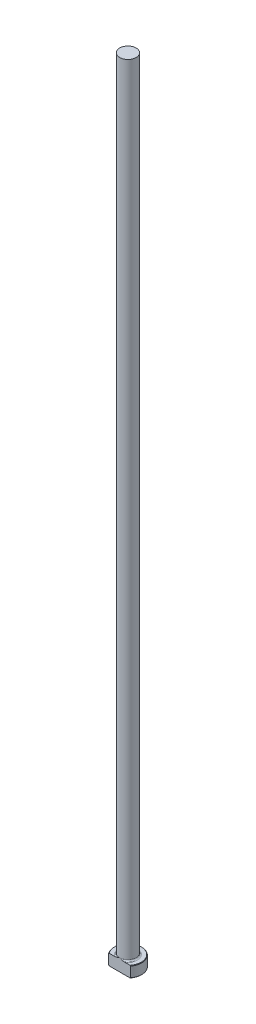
ISO-10303-21;
HEADER;
FILE_DESCRIPTION(('STEP AP214'),'2;1');
FILE_NAME('part.step','',(''),(''),'','','');
FILE_SCHEMA(('AUTOMOTIVE_DESIGN { 1 0 10303 214 1 1 1 1 }'));
ENDSEC;
DATA;
#1=APPLICATION_CONTEXT('core data for automotive mechanical design processes');
#2=APPLICATION_PROTOCOL_DEFINITION('international standard','automotive_design',2000,#1);
#3=PRODUCT_CONTEXT('',#1,'mechanical');
#4=PRODUCT('Part','Part','',(#3));
#5=PRODUCT_RELATED_PRODUCT_CATEGORY('part','',(#4));
#6=PRODUCT_DEFINITION_FORMATION('','',#4);
#7=PRODUCT_DEFINITION_CONTEXT('part definition',#1,'design');
#8=PRODUCT_DEFINITION('design','',#6,#7);
#9=PRODUCT_DEFINITION_SHAPE('','',#8);
#10=(LENGTH_UNIT() NAMED_UNIT(*) SI_UNIT(.MILLI.,.METRE.));
#11=(NAMED_UNIT(*) PLANE_ANGLE_UNIT() SI_UNIT($,.RADIAN.));
#12=(NAMED_UNIT(*) SI_UNIT($,.STERADIAN.) SOLID_ANGLE_UNIT());
#13=UNCERTAINTY_MEASURE_WITH_UNIT(LENGTH_MEASURE(1.E-05),#10,'distance_accuracy_value','');
#14=(GEOMETRIC_REPRESENTATION_CONTEXT(3) GLOBAL_UNCERTAINTY_ASSIGNED_CONTEXT((#13)) GLOBAL_UNIT_ASSIGNED_CONTEXT((#10,
#11,#12)) REPRESENTATION_CONTEXT('',''));
#15=CARTESIAN_POINT('',(0.,0.,0.));
#16=DIRECTION('',(0.,0.,1.));
#17=DIRECTION('',(1.,0.,0.));
#18=AXIS2_PLACEMENT_3D('',#15,#16,#17);
#19=CARTESIAN_POINT('',(0.,0.,0.));
#20=DIRECTION('',(0.,-1.,0.));
#21=DIRECTION('',(0.,0.,-1.));
#22=AXIS2_PLACEMENT_3D('',#19,#20,#21);
#23=PLANE('',#22);
#24=CARTESIAN_POINT('',(0.,0.,0.));
#25=DIRECTION('',(0.,-1.,0.));
#26=DIRECTION('',(0.,0.,-1.));
#27=AXIS2_PLACEMENT_3D('',#24,#25,#26);
#28=CIRCLE('',#27,7.68349999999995);
#29=CARTESIAN_POINT('',(-6.02949135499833,0.,4.76249999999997));
#30=VERTEX_POINT('',#29);
#31=CARTESIAN_POINT('',(6.02949135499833,0.,4.76249999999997));
#32=VERTEX_POINT('',#31);
#33=EDGE_CURVE('E98',#30,#32,#28,.T.);
#34=ORIENTED_EDGE('',*,*,#33,.T.);
#35=DIRECTION('',(-1.,0.,0.));
#36=VECTOR('',#35,1.);
#37=CARTESIAN_POINT('',(-6.34999999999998,0.,4.76249999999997));
#38=LINE('',#37,#36);
#39=EDGE_CURVE('E83',#32,#30,#38,.T.);
#40=ORIENTED_EDGE('',*,*,#39,.T.);
#41=EDGE_LOOP('',(#34,#40));
#42=FACE_BOUND('',#41,.T.);
#43=ADVANCED_FACE('F32',(#42),#23,.T.);
#44=CARTESIAN_POINT('',(0.,259.958771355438,0.));
#45=DIRECTION('',(0.,1.,0.));
#46=DIRECTION('',(0.,0.,1.));
#47=AXIS2_PLACEMENT_3D('',#44,#45,#46);
#48=CYLINDRICAL_SURFACE('',#47,7.93749999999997);
#49=CARTESIAN_POINT('',(0.,6.09599999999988,0.));
#50=DIRECTION('',(0.,1.,0.));
#51=DIRECTION('',(0.,0.,1.));
#52=AXIS2_PLACEMENT_3D('',#49,#50,#51);
#53=CIRCLE('',#52,7.93749999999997);
#54=CARTESIAN_POINT('',(-6.34999999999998,6.09599999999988,4.76249999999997));
#55=VERTEX_POINT('',#54);
#56=CARTESIAN_POINT('',(6.34999999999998,6.09599999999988,4.76249999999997));
#57=VERTEX_POINT('',#56);
#58=EDGE_CURVE('E104',#55,#57,#53,.F.);
#59=ORIENTED_EDGE('',*,*,#58,.T.);
#60=DIRECTION('',(0.,-1.,0.));
#61=VECTOR('',#60,1.);
#62=CARTESIAN_POINT('',(6.34999999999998,457.2,4.76249999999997));
#63=LINE('',#62,#61);
#64=CARTESIAN_POINT('',(6.34999999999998,0.254000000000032,4.76249999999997));
#65=VERTEX_POINT('',#64);
#66=EDGE_CURVE('E183',#57,#65,#63,.T.);
#67=ORIENTED_EDGE('',*,*,#66,.T.);
#68=CARTESIAN_POINT('',(0.,0.254000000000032,0.));
#69=DIRECTION('',(0.,-1.,0.));
#70=DIRECTION('',(0.,0.,-1.));
#71=AXIS2_PLACEMENT_3D('',#68,#69,#70);
#72=CIRCLE('',#71,7.93749999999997);
#73=CARTESIAN_POINT('',(-6.34999999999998,0.254000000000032,4.76249999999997));
#74=VERTEX_POINT('',#73);
#75=EDGE_CURVE('E100',#65,#74,#72,.F.);
#76=ORIENTED_EDGE('',*,*,#75,.T.);
#77=DIRECTION('',(0.,-1.,0.));
#78=VECTOR('',#77,1.);
#79=CARTESIAN_POINT('',(-6.34999999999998,457.2,4.76249999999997));
#80=LINE('',#79,#78);
#81=EDGE_CURVE('E93',#55,#74,#80,.T.);
#82=ORIENTED_EDGE('',*,*,#81,.F.);
#83=EDGE_LOOP('',(#59,#67,#76,#82));
#84=FACE_BOUND('',#83,.T.);
#85=ADVANCED_FACE('F158',(#84),#48,.T.);
#86=CARTESIAN_POINT('',(-7.93749999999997,6.35,0.));
#87=DIRECTION('',(0.,1.,0.));
#88=DIRECTION('',(0.,0.,1.));
#89=AXIS2_PLACEMENT_3D('',#86,#87,#88);
#90=PLANE('',#89);
#91=CARTESIAN_POINT('',(0.,6.35,0.));
#92=DIRECTION('',(0.,1.,0.));
#93=DIRECTION('',(0.,0.,1.));
#94=AXIS2_PLACEMENT_3D('',#91,#92,#93);
#95=CIRCLE('',#94,7.68349999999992);
#96=CARTESIAN_POINT('',(6.02949135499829,6.35,4.76249999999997));
#97=VERTEX_POINT('',#96);
#98=CARTESIAN_POINT('',(-6.02949135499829,6.35,4.76249999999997));
#99=VERTEX_POINT('',#98);
#100=EDGE_CURVE('E178',#97,#99,#95,.T.);
#101=ORIENTED_EDGE('',*,*,#100,.T.);
#102=DIRECTION('',(1.,0.,0.));
#103=VECTOR('',#102,1.);
#104=CARTESIAN_POINT('',(-7.93749999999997,6.35,4.76249999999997));
#105=LINE('',#104,#103);
#106=CARTESIAN_POINT('',(-2.79976677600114,6.35000000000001,4.76249999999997));
#107=VERTEX_POINT('',#106);
#108=EDGE_CURVE('E57',#99,#107,#105,.T.);
#109=ORIENTED_EDGE('',*,*,#108,.T.);
#110=CARTESIAN_POINT('',(0.,6.35,0.));
#111=DIRECTION('',(0.,1.,0.));
#112=DIRECTION('',(0.,0.,1.));
#113=AXIS2_PLACEMENT_3D('',#110,#111,#112);
#114=CIRCLE('',#113,5.52449999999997);
#115=CARTESIAN_POINT('',(2.79976677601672,6.35000000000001,4.76249999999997));
#116=VERTEX_POINT('',#115);
#117=EDGE_CURVE('E107',#107,#116,#114,.F.);
#118=ORIENTED_EDGE('',*,*,#117,.T.);
#119=EDGE_CURVE('E136',#116,#97,#105,.T.);
#120=ORIENTED_EDGE('',*,*,#119,.T.);
#121=EDGE_LOOP('',(#101,#109,#118,#120));
#122=FACE_BOUND('',#121,.T.);
#123=ADVANCED_FACE('F147',(#122),#90,.T.);
#124=CARTESIAN_POINT('',(0.,6.35000000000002,0.));
#125=DIRECTION('',(0.,-1.,0.));
#126=DIRECTION('',(0.,0.,-1.));
#127=AXIS2_PLACEMENT_3D('',#124,#125,#126);
#128=CONICAL_SURFACE('',#127,7.6834999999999,0.785398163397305);
#129=ORIENTED_EDGE('',*,*,#58,.F.);
#130=CARTESIAN_POINT('',(-13.9717238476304,-0.727613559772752,4.76249999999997));
#131=CARTESIAN_POINT('',(-13.7440124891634,-0.512084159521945,4.76249999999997));
#132=CARTESIAN_POINT('',(-13.5160318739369,-0.296838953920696,4.76249999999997));
#133=CARTESIAN_POINT('',(-13.0594385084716,0.132982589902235,4.76249999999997));
#134=CARTESIAN_POINT('',(-12.8308257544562,0.347558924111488,4.76249999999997));
#135=CARTESIAN_POINT('',(-12.1433698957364,0.990628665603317,4.76249999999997));
#136=CARTESIAN_POINT('',(-11.6834388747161,1.41796058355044,4.76249999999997));
#137=CARTESIAN_POINT('',(-10.7398192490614,2.28660831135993,4.76249999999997));
#138=CARTESIAN_POINT('',(-10.2559580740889,2.72773732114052,4.76249999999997));
#139=CARTESIAN_POINT('',(-9.52579613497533,3.38404130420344,4.76249999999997));
#140=CARTESIAN_POINT('',(-9.28181372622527,3.60179461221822,4.76249999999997));
#141=CARTESIAN_POINT('',(-8.79195583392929,4.0351595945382,4.76249999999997));
#142=CARTESIAN_POINT('',(-8.54608036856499,4.25077128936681,4.76249999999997));
#143=CARTESIAN_POINT('',(-8.05235063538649,4.67899963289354,4.76249999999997));
#144=CARTESIAN_POINT('',(-7.80449972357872,4.89162014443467,4.76249999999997));
#145=CARTESIAN_POINT('',(-7.30587283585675,5.31343752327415,4.76249999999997));
#146=CARTESIAN_POINT('',(-7.05509670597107,5.5226342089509,4.76249999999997));
#147=CARTESIAN_POINT('',(-6.54895570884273,5.9372628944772,4.76249999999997));
#148=CARTESIAN_POINT('',(-6.29357776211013,6.1426789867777,4.76249999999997));
#149=CARTESIAN_POINT('',(-5.77806261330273,6.54738613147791,4.76249999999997));
#150=CARTESIAN_POINT('',(-5.51792616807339,6.74667814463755,4.76249999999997));
#151=CARTESIAN_POINT('',(-4.99669315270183,7.1329036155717,4.76249999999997));
#152=CARTESIAN_POINT('',(-4.73572280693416,7.32000565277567,4.76249999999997));
#153=CARTESIAN_POINT('',(-4.33820944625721,7.5920559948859,4.76249999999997));
#154=CARTESIAN_POINT('',(-4.20463607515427,7.68134253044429,4.76249999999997));
#155=CARTESIAN_POINT('',(-3.93520014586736,7.85638938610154,4.76249999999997));
#156=CARTESIAN_POINT('',(-3.79933771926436,7.94214990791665,4.76249999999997));
#157=CARTESIAN_POINT('',(-3.52582078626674,8.10887856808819,4.76249999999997));
#158=CARTESIAN_POINT('',(-3.38818211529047,8.18987258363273,4.76249999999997));
#159=CARTESIAN_POINT('',(-3.10994368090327,8.34667799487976,4.76249999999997));
#160=CARTESIAN_POINT('',(-2.96934354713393,8.42248873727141,4.76249999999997));
#161=CARTESIAN_POINT('',(-2.6850931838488,8.56758570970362,4.76249999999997));
#162=CARTESIAN_POINT('',(-2.5414484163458,8.63688258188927,4.76249999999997));
#163=CARTESIAN_POINT('',(-2.25062082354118,8.76758710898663,4.76249999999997));
#164=CARTESIAN_POINT('',(-2.10343915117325,8.82899729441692,4.76249999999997));
#165=CARTESIAN_POINT('',(-1.88433335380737,8.91218004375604,4.76249999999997));
#166=CARTESIAN_POINT('',(-1.81383186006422,8.93772120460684,4.76249999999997));
#167=CARTESIAN_POINT('',(-1.67202052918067,8.98645907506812,4.76249999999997));
#168=CARTESIAN_POINT('',(-1.6007106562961,9.00965568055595,4.76249999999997));
#169=CARTESIAN_POINT('',(-1.38555472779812,9.07542289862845,4.76249999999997));
#170=CARTESIAN_POINT('',(-1.24050522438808,9.11416209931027,4.76249999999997));
#171=CARTESIAN_POINT('',(-0.948515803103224,9.17953563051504,4.76249999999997));
#172=CARTESIAN_POINT('',(-0.801590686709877,9.20623542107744,4.76249999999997));
#173=CARTESIAN_POINT('',(-0.50593058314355,9.24644001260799,4.76249999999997));
#174=CARTESIAN_POINT('',(-0.357195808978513,9.2599463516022,4.76249999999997));
#175=CARTESIAN_POINT('',(-0.0580773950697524,9.27300540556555,4.76249999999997));
#176=CARTESIAN_POINT('',(0.0923105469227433,9.27246142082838,4.76249999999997));
#177=CARTESIAN_POINT('',(0.392354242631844,9.25721584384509,4.76249999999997));
#178=CARTESIAN_POINT('',(0.542009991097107,9.24251415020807,4.76249999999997));
#179=CARTESIAN_POINT('',(0.840076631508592,9.19973713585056,4.76249999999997));
#180=CARTESIAN_POINT('',(0.988478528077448,9.17160009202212,4.76249999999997));
#181=CARTESIAN_POINT('',(1.28250292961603,9.10341431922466,4.76249999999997));
#182=CARTESIAN_POINT('',(1.42812484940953,9.06336311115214,4.76249999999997));
#183=CARTESIAN_POINT('',(1.80157652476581,8.94630142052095,4.76249999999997));
#184=CARTESIAN_POINT('',(2.02694427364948,8.86145845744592,4.76249999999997));
#185=CARTESIAN_POINT('',(2.46947102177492,8.67257542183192,4.76249999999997));
#186=CARTESIAN_POINT('',(2.68662307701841,8.56851952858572,4.76249999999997));
#187=CARTESIAN_POINT('',(3.00782565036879,8.40144847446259,4.76249999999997));
#188=CARTESIAN_POINT('',(3.11463323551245,8.34362692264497,4.76249999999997));
#189=CARTESIAN_POINT('',(3.32653927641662,8.22492412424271,4.76249999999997));
#190=CARTESIAN_POINT('',(3.43163771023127,8.1640428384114,4.76249999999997));
#191=CARTESIAN_POINT('',(3.64022442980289,8.03970047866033,4.76249999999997));
#192=CARTESIAN_POINT('',(3.7437134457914,7.97624062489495,4.76249999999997));
#193=CARTESIAN_POINT('',(3.94927417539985,7.84708004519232,4.76249999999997));
#194=CARTESIAN_POINT('',(4.05134594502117,7.7813794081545,4.76249999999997));
#195=CARTESIAN_POINT('',(4.39010681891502,7.55875403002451,4.76249999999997));
#196=CARTESIAN_POINT('',(4.62396840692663,7.39752115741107,4.76249999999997));
#197=CARTESIAN_POINT('',(5.08629215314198,7.06746483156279,4.76249999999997));
#198=CARTESIAN_POINT('',(5.31475310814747,6.8986397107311,4.76249999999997));
#199=CARTESIAN_POINT('',(5.76756292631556,6.55523763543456,4.76249999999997));
#200=CARTESIAN_POINT('',(5.9919086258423,6.38065652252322,4.76249999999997));
#201=CARTESIAN_POINT('',(6.43717517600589,6.02723273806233,4.76249999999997));
#202=CARTESIAN_POINT('',(6.65809630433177,5.84839041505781,4.76249999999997));
#203=CARTESIAN_POINT('',(7.09790647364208,5.48680641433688,4.76249999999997));
#204=CARTESIAN_POINT('',(7.31678672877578,5.30405407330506,4.76249999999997));
#205=CARTESIAN_POINT('',(7.75231370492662,4.93590430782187,4.76249999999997));
#206=CARTESIAN_POINT('',(7.96896038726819,4.75050683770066,4.76249999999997));
#207=CARTESIAN_POINT('',(8.4003252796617,4.37766695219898,4.76249999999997));
#208=CARTESIAN_POINT('',(8.61504426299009,4.19022543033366,4.76249999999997));
#209=CARTESIAN_POINT('',(9.04295707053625,3.81360841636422,4.76249999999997));
#210=CARTESIAN_POINT('',(9.25615088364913,3.62443291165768,4.76249999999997));
#211=CARTESIAN_POINT('',(9.85099823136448,3.09302727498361,4.76249999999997));
#212=CARTESIAN_POINT('',(10.2312296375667,2.74920552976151,4.76249999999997));
#213=CARTESIAN_POINT('',(10.9886755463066,2.05817278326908,4.76249999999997));
#214=CARTESIAN_POINT('',(11.3658896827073,1.71096138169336,4.76249999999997));
#215=CARTESIAN_POINT('',(12.1155837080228,1.01624347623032,4.76249999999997));
#216=CARTESIAN_POINT('',(12.4880784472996,0.668752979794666,4.76249999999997));
#217=CARTESIAN_POINT('',(13.2311819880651,-0.0281268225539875,4.76249999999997));
#218=CARTESIAN_POINT('',(13.601791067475,-0.377515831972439,4.76249999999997));
#219=CARTESIAN_POINT('',(13.9717238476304,-0.727613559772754,4.76249999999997));
#220=B_SPLINE_CURVE_WITH_KNOTS('',3,(#130,#131,#132,#133,#134,#135,#136,#137,#138,#139,#140,
#141,#142,#143,#144,#145,#146,#147,#148,#149,#150,#151,#152,#153,#154,#155,#156,#157,#158,#159,
#160,#161,#162,#163,#164,#165,#166,#167,#168,#169,#170,#171,#172,#173,#174,#175,#176,#177,#178,
#179,#180,#181,#182,#183,#184,#185,#186,#187,#188,#189,#190,#191,#192,#193,#194,#195,#196,#197,
#198,#199,#200,#201,#202,#203,#204,#205,#206,#207,#208,#209,#210,#211,#212,#213,#214,#215,#216,
#217,#218,#219),.UNSPECIFIED.,.F.,.F.,(4,2,2,2,2,2,2,2,2,2,2,2,2,2,2,2,2,2,2,2,2,2,2,2,2,2,2,2,
2,2,2,2,2,2,2,2,2,2,2,2,2,2,2,2,4),(0.,0.940610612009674,1.88122685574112,3.76464908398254,
5.72889030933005,6.7099492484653,7.69099877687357,8.67063680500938,9.65032663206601,
10.6334769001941,11.6164721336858,12.5795523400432,13.0615108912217,13.543441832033,
14.022454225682,14.5015268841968,14.9798027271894,15.457924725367,15.6828447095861,
15.9077746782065,16.3577079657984,16.8051644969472,17.2525688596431,17.703053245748,
18.1535408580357,18.606118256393,19.0587898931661,19.779913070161,20.5016327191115,
20.8659558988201,21.2302837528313,21.5944411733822,21.958584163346,22.8105074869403,
23.6626188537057,24.515359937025,25.3680315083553,26.2234368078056,27.0788568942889,
27.9339169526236,28.7889832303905,30.3268416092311,31.8648838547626,33.393116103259,
34.9211161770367),.UNSPECIFIED.);
#221=EDGE_CURVE('E135',#55,#99,#220,.T.);
#222=ORIENTED_EDGE('',*,*,#221,.T.);
#223=ORIENTED_EDGE('',*,*,#100,.F.);
#224=EDGE_CURVE('E127',#97,#57,#220,.T.);
#225=ORIENTED_EDGE('',*,*,#224,.T.);
#226=EDGE_LOOP('',(#129,#222,#223,#225));
#227=FACE_BOUND('',#226,.T.);
#228=ADVANCED_FACE('F143',(#227),#128,.T.);
#229=CARTESIAN_POINT('',(0.,0.254000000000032,0.));
#230=DIRECTION('',(0.,1.,0.));
#231=DIRECTION('',(0.,0.,1.));
#232=AXIS2_PLACEMENT_3D('',#229,#230,#231);
#233=CONICAL_SURFACE('',#232,7.93749999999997,0.785398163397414);
#234=ORIENTED_EDGE('',*,*,#75,.F.);
#235=CARTESIAN_POINT('',(13.9717238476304,7.07761355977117,4.76249999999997));
#236=CARTESIAN_POINT('',(13.7440124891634,6.8620841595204,4.76249999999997));
#237=CARTESIAN_POINT('',(13.5160318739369,6.64683895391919,4.76249999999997));
#238=CARTESIAN_POINT('',(13.0594385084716,6.21701741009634,4.76249999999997));
#239=CARTESIAN_POINT('',(12.8308257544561,6.00244107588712,4.76249999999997));
#240=CARTESIAN_POINT('',(12.1433698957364,5.3593713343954,4.76249999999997));
#241=CARTESIAN_POINT('',(11.683438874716,4.93203941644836,4.76249999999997));
#242=CARTESIAN_POINT('',(10.7398192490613,4.06339168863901,4.76249999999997));
#243=CARTESIAN_POINT('',(10.2559580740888,3.6222626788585,4.76249999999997));
#244=CARTESIAN_POINT('',(9.52579613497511,2.96595869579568,4.76249999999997));
#245=CARTESIAN_POINT('',(9.28181372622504,2.74820538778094,4.76249999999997));
#246=CARTESIAN_POINT('',(8.79195583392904,2.31484040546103,4.76249999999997));
#247=CARTESIAN_POINT('',(8.54608036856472,2.09922871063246,4.76249999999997));
#248=CARTESIAN_POINT('',(8.0523506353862,1.67100036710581,4.76249999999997));
#249=CARTESIAN_POINT('',(7.80449972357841,1.45837985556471,4.76249999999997));
#250=CARTESIAN_POINT('',(7.30587283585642,1.03656247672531,4.76249999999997));
#251=CARTESIAN_POINT('',(7.05509670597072,0.827365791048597,4.76249999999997));
#252=CARTESIAN_POINT('',(6.54895570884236,0.412737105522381,4.76249999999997));
#253=CARTESIAN_POINT('',(6.29357776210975,0.207321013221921,4.76249999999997));
#254=CARTESIAN_POINT('',(5.77806261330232,-0.197386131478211,4.76249999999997));
#255=CARTESIAN_POINT('',(5.51792616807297,-0.396678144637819,4.76249999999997));
#256=CARTESIAN_POINT('',(4.99669315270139,-0.782903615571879,4.76249999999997));
#257=CARTESIAN_POINT('',(4.73572280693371,-0.970005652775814,4.76249999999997));
#258=CARTESIAN_POINT('',(4.33820944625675,-1.24205599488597,4.76249999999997));
#259=CARTESIAN_POINT('',(4.2046360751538,-1.33134253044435,4.76249999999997));
#260=CARTESIAN_POINT('',(3.93520014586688,-1.50638938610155,4.76249999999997));
#261=CARTESIAN_POINT('',(3.79933771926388,-1.59214990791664,4.76249999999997));
#262=CARTESIAN_POINT('',(3.52582078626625,-1.75887856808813,4.76249999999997));
#263=CARTESIAN_POINT('',(3.38818211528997,-1.83987258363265,4.76249999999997));
#264=CARTESIAN_POINT('',(3.10994368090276,-1.99667799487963,4.76249999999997));
#265=CARTESIAN_POINT('',(2.96934354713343,-2.07248873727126,4.76249999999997));
#266=CARTESIAN_POINT('',(2.68509318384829,-2.21758570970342,4.76249999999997));
#267=CARTESIAN_POINT('',(2.54144841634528,-2.28688258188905,4.76249999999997));
#268=CARTESIAN_POINT('',(2.25062082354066,-2.41758710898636,4.76249999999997));
#269=CARTESIAN_POINT('',(2.10343915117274,-2.47899729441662,4.76249999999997));
#270=CARTESIAN_POINT('',(1.88433335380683,-2.56218004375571,4.76249999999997));
#271=CARTESIAN_POINT('',(1.81383186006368,-2.58772120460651,4.76249999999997));
#272=CARTESIAN_POINT('',(1.6720205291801,-2.63645907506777,4.76249999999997));
#273=CARTESIAN_POINT('',(1.60071065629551,-2.65965568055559,4.76249999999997));
#274=CARTESIAN_POINT('',(1.38555472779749,-2.72542289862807,4.76249999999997));
#275=CARTESIAN_POINT('',(1.24050522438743,-2.76416209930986,4.76249999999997));
#276=CARTESIAN_POINT('',(0.948515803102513,-2.8295356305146,4.76249999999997));
#277=CARTESIAN_POINT('',(0.801590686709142,-2.85623542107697,4.76249999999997));
#278=CARTESIAN_POINT('',(0.505930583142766,-2.89644001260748,4.76249999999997));
#279=CARTESIAN_POINT('',(0.357195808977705,-2.90994635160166,4.76249999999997));
#280=CARTESIAN_POINT('',(0.0580773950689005,-2.92300540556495,4.76249999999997));
#281=CARTESIAN_POINT('',(-0.0923105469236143,-2.92246142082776,4.76249999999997));
#282=CARTESIAN_POINT('',(-0.392354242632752,-2.90721584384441,4.76249999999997));
#283=CARTESIAN_POINT('',(-0.542009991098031,-2.89251415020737,4.76249999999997));
#284=CARTESIAN_POINT('',(-0.840076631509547,-2.8497371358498,4.76249999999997));
#285=CARTESIAN_POINT('',(-0.988478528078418,-2.82160009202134,4.76249999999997));
#286=CARTESIAN_POINT('',(-1.28250292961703,-2.75341431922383,4.76249999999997));
#287=CARTESIAN_POINT('',(-1.42812484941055,-2.71336311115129,4.76249999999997));
#288=CARTESIAN_POINT('',(-1.80157652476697,-2.59630142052,4.76249999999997));
#289=CARTESIAN_POINT('',(-2.02694427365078,-2.5114584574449,4.76249999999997));
#290=CARTESIAN_POINT('',(-2.46947102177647,-2.32257542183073,4.76249999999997));
#291=CARTESIAN_POINT('',(-2.68662307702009,-2.21851952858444,4.76249999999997));
#292=CARTESIAN_POINT('',(-3.00782565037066,-2.05144847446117,4.76249999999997));
#293=CARTESIAN_POINT('',(-3.11463323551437,-1.99362692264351,4.76249999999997));
#294=CARTESIAN_POINT('',(-3.32653927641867,-1.87492412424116,4.76249999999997));
#295=CARTESIAN_POINT('',(-3.43163771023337,-1.8140428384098,4.76249999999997));
#296=CARTESIAN_POINT('',(-3.64022442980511,-1.68970047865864,4.76249999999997));
#297=CARTESIAN_POINT('',(-3.74371344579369,-1.62624062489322,4.76249999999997));
#298=CARTESIAN_POINT('',(-3.94927417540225,-1.49708004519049,4.76249999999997));
#299=CARTESIAN_POINT('',(-4.05134594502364,-1.43137940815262,4.76249999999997));
#300=CARTESIAN_POINT('',(-4.39010681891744,-1.20875403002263,4.76249999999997));
#301=CARTESIAN_POINT('',(-4.62396840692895,-1.04752115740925,4.76249999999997));
#302=CARTESIAN_POINT('',(-5.08629215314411,-0.717464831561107,4.76249999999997));
#303=CARTESIAN_POINT('',(-5.31475310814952,-0.548639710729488,4.76249999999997));
#304=CARTESIAN_POINT('',(-5.76756292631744,-0.205237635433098,4.76249999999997));
#305=CARTESIAN_POINT('',(-5.9919086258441,-0.0306565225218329,4.76249999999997));
#306=CARTESIAN_POINT('',(-6.43717517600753,0.32276726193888,4.76249999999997));
#307=CARTESIAN_POINT('',(-6.65809630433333,0.501609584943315,4.76249999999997));
#308=CARTESIAN_POINT('',(-7.09790647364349,0.863193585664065,4.76249999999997));
#309=CARTESIAN_POINT('',(-7.31678672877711,1.0459459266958,4.76249999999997));
#310=CARTESIAN_POINT('',(-7.75231370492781,1.4140956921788,4.76249999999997));
#311=CARTESIAN_POINT('',(-7.96896038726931,1.59949316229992,4.76249999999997));
#312=CARTESIAN_POINT('',(-8.40032527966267,1.9723330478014,4.76249999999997));
#313=CARTESIAN_POINT('',(-8.615044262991,2.15977456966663,4.76249999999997));
#314=CARTESIAN_POINT('',(-9.04295707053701,2.53639158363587,4.76249999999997));
#315=CARTESIAN_POINT('',(-9.25615088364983,2.72556708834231,4.76249999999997));
#316=CARTESIAN_POINT('',(-9.85099823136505,3.25697272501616,4.76249999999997));
#317=CARTESIAN_POINT('',(-10.2312296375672,3.60079447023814,4.76249999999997));
#318=CARTESIAN_POINT('',(-10.988675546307,4.29182721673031,4.76249999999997));
#319=CARTESIAN_POINT('',(-11.3658896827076,4.6390386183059,4.76249999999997));
#320=CARTESIAN_POINT('',(-12.115583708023,5.33375652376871,4.76249999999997));
#321=CARTESIAN_POINT('',(-12.4880784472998,5.68124702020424,4.76249999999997));
#322=CARTESIAN_POINT('',(-13.2311819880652,6.37812682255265,4.76249999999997));
#323=CARTESIAN_POINT('',(-13.601791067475,6.72751583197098,4.76249999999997));
#324=CARTESIAN_POINT('',(-13.9717238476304,7.07761355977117,4.76249999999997));
#325=B_SPLINE_CURVE_WITH_KNOTS('',3,(#235,#236,#237,#238,#239,#240,#241,#242,#243,#244,#245,
#246,#247,#248,#249,#250,#251,#252,#253,#254,#255,#256,#257,#258,#259,#260,#261,#262,#263,#264,
#265,#266,#267,#268,#269,#270,#271,#272,#273,#274,#275,#276,#277,#278,#279,#280,#281,#282,#283,
#284,#285,#286,#287,#288,#289,#290,#291,#292,#293,#294,#295,#296,#297,#298,#299,#300,#301,#302,
#303,#304,#305,#306,#307,#308,#309,#310,#311,#312,#313,#314,#315,#316,#317,#318,#319,#320,#321,
#322,#323,#324),.UNSPECIFIED.,.F.,.F.,(4,2,2,2,2,2,2,2,2,2,2,2,2,2,2,2,2,2,2,2,2,2,2,2,2,2,2,2,
2,2,2,2,2,2,2,2,2,2,2,2,2,2,2,2,4),(0.,0.94061061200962,1.88122685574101,3.76464908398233,
5.72889030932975,6.70994924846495,7.69099877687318,8.67063680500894,9.65032663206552,
10.6334769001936,11.6164721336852,12.5795523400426,13.061510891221,13.5434418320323,
14.0224542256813,14.5015268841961,14.9798027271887,15.4579247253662,15.6828447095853,
15.9077746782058,16.3577079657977,16.8051644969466,17.2525688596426,17.7030532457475,
18.1535408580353,18.6061182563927,19.0587898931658,19.7799130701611,20.5016327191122,
20.8659558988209,21.2302837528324,21.5944411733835,21.9585841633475,22.8105074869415,
23.6626188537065,24.5153599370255,25.3680315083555,26.2234368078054,27.0788568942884,
27.9339169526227,28.7889832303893,30.3268416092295,31.8648838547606,33.3931161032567,
34.921116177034),.UNSPECIFIED.);
#326=EDGE_CURVE('E86',#65,#32,#325,.T.);
#327=ORIENTED_EDGE('',*,*,#326,.T.);
#328=ORIENTED_EDGE('',*,*,#33,.F.);
#329=EDGE_CURVE('E89',#30,#74,#325,.T.);
#330=ORIENTED_EDGE('',*,*,#329,.T.);
#331=EDGE_LOOP('',(#234,#327,#328,#330));
#332=FACE_BOUND('',#331,.T.);
#333=ADVANCED_FACE('F97',(#332),#233,.T.);
#334=CARTESIAN_POINT('',(0.,7.11200000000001,0.));
#335=DIRECTION('',(0.,1.,0.));
#336=DIRECTION('',(0.,0.,1.));
#337=AXIS2_PLACEMENT_3D('',#334,#335,#336);
#338=TOROIDAL_SURFACE('',#337,5.52449999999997,0.762);
#339=CARTESIAN_POINT('',(0.,7.11200000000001,4.76249999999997));
#340=CARTESIAN_POINT('',(1.7571576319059E-10,7.11200099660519,4.76249999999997));
#341=CARTESIAN_POINT('',(2.11716127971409E-07,7.11200199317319,4.76249999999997));
#342=CARTESIAN_POINT('',(8.80753956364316E-07,7.1120039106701,4.76249999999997));
#343=CARTESIAN_POINT('',(1.34491796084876E-06,7.11200482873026,4.76249999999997));
#344=CARTESIAN_POINT('',(2.45982947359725E-06,7.11200666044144,4.76249999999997));
#345=CARTESIAN_POINT('',(3.12384157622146E-06,7.11200756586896,4.76249999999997));
#346=CARTESIAN_POINT('',(4.5550794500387E-06,7.11200927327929,4.76249999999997));
#347=CARTESIAN_POINT('',(5.32136303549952E-06,7.11201007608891,4.76249999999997));
#348=CARTESIAN_POINT('',(8.07192927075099E-06,7.11201277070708,4.76249999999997));
#349=CARTESIAN_POINT('',(1.01901643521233E-05,7.11201452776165,4.76249999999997));
#350=CARTESIAN_POINT('',(1.4565159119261E-05,7.11201765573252,4.76249999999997));
#351=CARTESIAN_POINT('',(1.68139275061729E-05,7.11201903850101,4.76249999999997));
#352=CARTESIAN_POINT('',(2.56002968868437E-05,7.1120242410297,4.76249999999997));
#353=CARTESIAN_POINT('',(3.23057719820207E-05,7.11202779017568,4.76249999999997));
#354=CARTESIAN_POINT('',(4.55210144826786E-05,7.11203358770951,4.76249999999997));
#355=CARTESIAN_POINT('',(5.19929180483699E-05,7.1120359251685,4.76249999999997));
#356=CARTESIAN_POINT('',(7.95921607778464E-05,7.11204586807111,4.76249999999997));
#357=CARTESIAN_POINT('',(0.000100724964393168,7.11205341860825,4.76249999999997));
#358=CARTESIAN_POINT('',(0.00014026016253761,7.11206552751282,4.76249999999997));
#359=CARTESIAN_POINT('',(0.000158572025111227,7.11207036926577,4.76249999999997));
#360=CARTESIAN_POINT('',(0.000291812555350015,7.11210874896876,4.76249999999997));
#361=CARTESIAN_POINT('',(0.000401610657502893,7.11215771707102,4.76249999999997));
#362=CARTESIAN_POINT('',(0.0008287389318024,7.1123412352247,4.76249999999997));
#363=CARTESIAN_POINT('',(0.00114963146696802,7.11246431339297,4.76249999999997));
#364=CARTESIAN_POINT('',(0.00239628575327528,7.11294956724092,4.76249999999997));
#365=CARTESIAN_POINT('',(0.00331839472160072,7.11332376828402,4.76249999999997));
#366=CARTESIAN_POINT('',(0.00709602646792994,7.11484953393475,4.76249999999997));
#367=CARTESIAN_POINT('',(0.00995556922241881,7.11598757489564,4.76249999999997));
#368=CARTESIAN_POINT('',(0.0776380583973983,7.14293320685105,4.76249999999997));
#369=CARTESIAN_POINT('',(0.142407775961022,7.16892226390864,4.76249999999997));
#370=CARTESIAN_POINT('',(0.269647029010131,7.2196189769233,4.76249999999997));
#371=CARTESIAN_POINT('',(0.332112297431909,7.24433828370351,4.76249999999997));
#372=CARTESIAN_POINT('',(0.464537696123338,7.29630170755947,4.76249999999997));
#373=CARTESIAN_POINT('',(0.534515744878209,7.32350106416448,4.76249999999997));
#374=CARTESIAN_POINT('',(0.67548014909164,7.3774238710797,4.76249999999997));
#375=CARTESIAN_POINT('',(0.746469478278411,7.40413956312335,4.76249999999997));
#376=CARTESIAN_POINT('',(0.870073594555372,7.44962494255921,4.76249999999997));
#377=CARTESIAN_POINT('',(0.922600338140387,7.46863321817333,4.76249999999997));
#378=CARTESIAN_POINT('',(1.02776923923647,7.50591527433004,4.76249999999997));
#379=CARTESIAN_POINT('',(1.08041080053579,7.52419073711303,4.76249999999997));
#380=CARTESIAN_POINT('',(1.23635883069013,7.5769919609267,4.76249999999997));
#381=CARTESIAN_POINT('',(1.34005657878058,7.61037532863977,4.76249999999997));
#382=CARTESIAN_POINT('',(1.56359060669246,7.67746997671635,4.76249999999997));
#383=CARTESIAN_POINT('',(1.68362015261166,7.71054957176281,4.76249999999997));
#384=CARTESIAN_POINT('',(1.92642555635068,7.76967498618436,4.76249999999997));
#385=CARTESIAN_POINT('',(2.04921557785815,7.79566353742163,4.76249999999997));
#386=CARTESIAN_POINT('',(2.30422797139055,7.83918726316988,4.76249999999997));
#387=CARTESIAN_POINT('',(2.43656426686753,7.85610069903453,4.76249999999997));
#388=CARTESIAN_POINT('',(2.63563546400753,7.8702758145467,4.76249999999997));
#389=CARTESIAN_POINT('',(2.70197039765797,7.87313972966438,4.76249999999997));
#390=CARTESIAN_POINT('',(2.83467605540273,7.87452977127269,4.76249999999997));
#391=CARTESIAN_POINT('',(2.90104677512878,7.87305634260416,4.76249999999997));
#392=CARTESIAN_POINT('',(3.06624711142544,7.86305254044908,4.76249999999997));
#393=CARTESIAN_POINT('',(3.1649502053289,7.85140164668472,4.76249999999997));
#394=CARTESIAN_POINT('',(3.3102514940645,7.82310986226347,4.76249999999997));
#395=CARTESIAN_POINT('',(3.35793795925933,7.81197880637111,4.76249999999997));
#396=CARTESIAN_POINT('',(3.45215770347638,7.78564548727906,4.76249999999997));
#397=CARTESIAN_POINT('',(3.49869187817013,7.77044650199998,4.76249999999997));
#398=CARTESIAN_POINT('',(3.59306902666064,7.73421407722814,4.76249999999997));
#399=CARTESIAN_POINT('',(3.64079022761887,7.71285751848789,4.76249999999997));
#400=CARTESIAN_POINT('',(3.73313951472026,7.66398014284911,4.76249999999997));
#401=CARTESIAN_POINT('',(3.77776331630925,7.63645100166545,4.76249999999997));
#402=CARTESIAN_POINT('',(3.8538778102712,7.58041326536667,4.76249999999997));
#403=CARTESIAN_POINT('',(3.88624519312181,7.55310714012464,4.76249999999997));
#404=CARTESIAN_POINT('',(3.94622799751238,7.49369496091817,4.76249999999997));
#405=CARTESIAN_POINT('',(3.97385320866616,7.46159905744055,4.76249999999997));
#406=CARTESIAN_POINT('',(4.01655184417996,7.4011650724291,4.76249999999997));
#407=CARTESIAN_POINT('',(4.03304226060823,7.37383278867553,4.76249999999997));
#408=CARTESIAN_POINT('',(4.06135260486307,7.31682811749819,4.76249999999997));
#409=CARTESIAN_POINT('',(4.07317539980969,7.28715718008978,4.76249999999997));
#410=CARTESIAN_POINT('',(4.09136459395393,7.22592510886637,4.76249999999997));
#411=CARTESIAN_POINT('',(4.09769076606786,7.19435181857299,4.76249999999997));
#412=CARTESIAN_POINT('',(4.10417375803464,7.13057793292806,4.76249999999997));
#413=CARTESIAN_POINT('',(4.10433369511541,7.0983776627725,4.76249999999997));
#414=CARTESIAN_POINT('',(4.09881588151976,7.03816798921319,4.76249999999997));
#415=CARTESIAN_POINT('',(4.09379438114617,7.01009545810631,4.76249999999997));
#416=CARTESIAN_POINT('',(4.07925766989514,6.95514890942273,4.76249999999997));
#417=CARTESIAN_POINT('',(4.06974176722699,6.92827507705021,4.76249999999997));
#418=CARTESIAN_POINT('',(4.04639465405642,6.87537805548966,4.76249999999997));
#419=CARTESIAN_POINT('',(4.03242569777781,6.84941634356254,4.76249999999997));
#420=CARTESIAN_POINT('',(4.00102190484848,6.79970293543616,4.76249999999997));
#421=CARTESIAN_POINT('',(3.98358563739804,6.77595215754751,4.76249999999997));
#422=CARTESIAN_POINT('',(3.93494606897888,6.71761387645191,4.76249999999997));
#423=CARTESIAN_POINT('',(3.90164076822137,6.68477550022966,4.76249999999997));
#424=CARTESIAN_POINT('',(3.83023707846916,6.62476083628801,4.76249999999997));
#425=CARTESIAN_POINT('',(3.79212391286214,6.59760272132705,4.76249999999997));
#426=CARTESIAN_POINT('',(3.69123876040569,6.53519525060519,4.76249999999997));
#427=CARTESIAN_POINT('',(3.62627547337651,6.5035096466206,4.76249999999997));
#428=CARTESIAN_POINT('',(3.49255240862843,6.45041788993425,4.76249999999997));
#429=CARTESIAN_POINT('',(3.42379589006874,6.42900306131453,4.76249999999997));
#430=CARTESIAN_POINT('',(3.29415895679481,6.39697273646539,4.76249999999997));
#431=CARTESIAN_POINT('',(3.23354049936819,6.38525800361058,4.76249999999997));
#432=CARTESIAN_POINT('',(3.11149484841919,6.36705546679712,4.76249999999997));
#433=CARTESIAN_POINT('',(3.05006701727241,6.36057206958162,4.76249999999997));
#434=CARTESIAN_POINT('',(2.92589148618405,6.35201311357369,4.76249999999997));
#435=CARTESIAN_POINT('',(2.86313887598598,6.35001297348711,4.76249999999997));
#436=CARTESIAN_POINT('',(2.73768820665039,6.34998716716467,4.76249999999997));
#437=CARTESIAN_POINT('',(2.67499013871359,6.35195889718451,4.76249999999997));
#438=CARTESIAN_POINT('',(2.52932457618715,6.3605299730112,4.76249999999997));
#439=CARTESIAN_POINT('',(2.44643477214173,6.36843196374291,4.76249999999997));
#440=CARTESIAN_POINT('',(2.28127175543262,6.38922870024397,4.76249999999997));
#441=CARTESIAN_POINT('',(2.19899884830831,6.40212577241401,4.76249999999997));
#442=CARTESIAN_POINT('',(1.95269348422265,6.44712458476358,4.76249999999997));
#443=CARTESIAN_POINT('',(1.78980549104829,6.48548332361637,4.76249999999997));
#444=CARTESIAN_POINT('',(1.48033682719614,6.56994207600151,4.76249999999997));
#445=CARTESIAN_POINT('',(1.33350347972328,6.615164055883,4.76249999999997));
#446=CARTESIAN_POINT('',(1.04345459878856,6.71161170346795,4.76249999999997));
#447=CARTESIAN_POINT('',(0.900217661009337,6.76277370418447,4.76249999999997));
#448=CARTESIAN_POINT('',(0.704750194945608,6.83559047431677,4.76249999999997));
#449=CARTESIAN_POINT('',(0.651886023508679,6.85558735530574,4.76249999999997));
#450=CARTESIAN_POINT('',(0.544940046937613,6.89652727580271,4.76249999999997));
#451=CARTESIAN_POINT('',(0.49086245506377,6.91748138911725,4.76249999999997));
#452=CARTESIAN_POINT('',(0.399545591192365,6.95317215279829,4.76249999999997));
#453=CARTESIAN_POINT('',(0.362273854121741,6.96782635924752,4.76249999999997));
#454=CARTESIAN_POINT('',(0.288146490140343,6.9971046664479,4.76249999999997));
#455=CARTESIAN_POINT('',(0.251290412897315,7.01172761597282,4.76249999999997));
#456=CARTESIAN_POINT('',(0.181451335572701,7.03949988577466,4.76249999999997));
#457=CARTESIAN_POINT('',(0.14846593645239,7.05264357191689,4.76249999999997));
#458=CARTESIAN_POINT('',(0.0812672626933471,7.07951218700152,4.76249999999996));
#459=CARTESIAN_POINT('',(0.0470550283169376,7.09324020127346,4.76249999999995));
#460=CARTESIAN_POINT('',(0.00995870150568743,7.10801136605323,4.76249999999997));
#461=CARTESIAN_POINT('',(0.00710220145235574,7.10914804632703,4.76249999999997));
#462=CARTESIAN_POINT('',(0.00332530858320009,7.11067346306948,4.76249999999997));
#463=CARTESIAN_POINT('',(0.00240087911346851,7.11104861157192,4.76249999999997));
#464=CARTESIAN_POINT('',(0.0011512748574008,7.11153501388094,4.76249999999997));
#465=CARTESIAN_POINT('',(0.000829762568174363,7.11165833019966,4.76249999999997));
#466=CARTESIAN_POINT('',(0.000401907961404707,7.1118421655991,4.76249999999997));
#467=CARTESIAN_POINT('',(0.000291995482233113,7.11189118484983,4.76249999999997));
#468=CARTESIAN_POINT('',(0.000158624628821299,7.11192959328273,4.76249999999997));
#469=CARTESIAN_POINT('',(0.000140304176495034,7.11193443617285,4.76249999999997));
#470=CARTESIAN_POINT('',(0.000100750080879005,7.11194655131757,4.76249999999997));
#471=CARTESIAN_POINT('',(7.96072020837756E-05,7.11195410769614,4.76249999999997));
#472=CARTESIAN_POINT('',(5.19966524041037E-05,7.11196405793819,4.76249999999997));
#473=CARTESIAN_POINT('',(4.55234098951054E-05,7.11196639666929,4.76249999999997));
#474=CARTESIAN_POINT('',(3.23056445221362E-05,7.11197219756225,4.76249999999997));
#475=CARTESIAN_POINT('',(2.559903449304E-05,7.11197574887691,4.76249999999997));
#476=CARTESIAN_POINT('',(1.68115971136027E-05,7.11198095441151,4.76249999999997));
#477=CARTESIAN_POINT('',(1.45627239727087E-05,7.11198233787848,4.76249999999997));
#478=CARTESIAN_POINT('',(1.01876581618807E-05,7.11198546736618,4.76249999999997));
#479=CARTESIAN_POINT('',(8.06946388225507E-06,7.11198722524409,4.76249999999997));
#480=CARTESIAN_POINT('',(5.31911935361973E-06,7.1119899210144,4.76249999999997));
#481=CARTESIAN_POINT('',(4.55293266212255E-06,7.11199072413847,4.76249999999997));
#482=CARTESIAN_POINT('',(3.12194490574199E-06,7.11199243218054,4.76249999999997));
#483=CARTESIAN_POINT('',(2.45808667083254E-06,7.11199333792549,4.76249999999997));
#484=CARTESIAN_POINT('',(1.34354729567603E-06,7.11199517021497,4.76249999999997));
#485=CARTESIAN_POINT('',(8.79593877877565E-07,7.11199608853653,4.76249999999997));
#486=CARTESIAN_POINT('',(2.11067520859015E-07,7.11199800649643,4.76249999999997));
#487=CARTESIAN_POINT('',(-1.75738333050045E-10,7.11199900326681,4.76249999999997));
#488=CARTESIAN_POINT('',(0.,7.11200000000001,4.76249999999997));
#489=B_SPLINE_CURVE_WITH_KNOTS('',3,(#339,#340,#341,#342,#343,#344,#345,#346,#347,#348,#349,
#350,#351,#352,#353,#354,#355,#356,#357,#358,#359,#360,#361,#362,#363,#364,#365,#366,#367,#368,
#369,#370,#371,#372,#373,#374,#375,#376,#377,#378,#379,#380,#381,#382,#383,#384,#385,#386,#387,
#388,#389,#390,#391,#392,#393,#394,#395,#396,#397,#398,#399,#400,#401,#402,#403,#404,#405,#406,
#407,#408,#409,#410,#411,#412,#413,#414,#415,#416,#417,#418,#419,#420,#421,#422,#423,#424,#425,
#426,#427,#428,#429,#430,#431,#432,#433,#434,#435,#436,#437,#438,#439,#440,#441,#442,#443,#444,
#445,#446,#447,#448,#449,#450,#451,#452,#453,#454,#455,#456,#457,#458,#459,#460,#461,#462,#463,
#464,#465,#466,#467,#468,#469,#470,#471,#472,#473,#474,#475,#476,#477,#478,#479,#480,#481,#482,
#483,#484,#485,#486,#487,#488),.UNSPECIFIED.,.T.,.F.,(4,2,2,2,2,2,2,2,2,2,2,2,2,2,2,2,2,2,2,2,2,
2,2,2,2,2,2,2,2,2,2,2,2,2,2,2,2,2,2,2,2,2,2,2,2,2,2,2,2,2,2,2,2,2,2,2,2,2,2,2,2,2,2,2,2,2,2,2,2,
2,2,2,2,2,4),(0.,2.98829248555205E-06,6.05956342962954E-06,9.41423004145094E-06,
1.27398874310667E-05,2.09563297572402E-05,2.88697099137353E-05,5.15590448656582E-05,
7.21804381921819E-05,0.000139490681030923,0.000196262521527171,0.00055555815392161,
0.00158774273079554,0.00457176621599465,0.0138062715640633,0.223151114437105,0.424691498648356,
0.649921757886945,0.877465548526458,1.04504215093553,1.21220902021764,1.5389642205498,
1.91230059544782,2.28856838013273,2.68809156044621,2.88715755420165,3.08620313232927,
3.3833626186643,3.5301266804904,3.67677283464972,3.83326124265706,3.98996197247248,
4.1165818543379,4.24293711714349,4.33833631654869,4.43367682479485,4.52970934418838,
4.62569331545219,4.71085370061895,4.79602719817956,4.88414369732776,4.9722966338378,
5.1118129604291,5.25176903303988,5.46739168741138,5.6828318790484,5.86779164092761,
6.05290704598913,6.24111386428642,6.42919734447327,6.67879819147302,6.92851542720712,
7.42983936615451,7.89058054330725,8.3467738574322,8.51633402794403,8.69031772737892,
8.81046509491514,8.92941700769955,9.03594279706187,9.14652227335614,9.15574682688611,
9.15873836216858,9.15977254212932,9.16013221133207,9.16018900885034,9.16025635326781,
9.16027697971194,9.16029967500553,9.16030758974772,9.16031580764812,9.16031913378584,
9.16032248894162,9.1603255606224,9.16032854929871),.UNSPECIFIED.);
#490=CARTESIAN_POINT('',(0.,7.11200000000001,4.76249999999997));
#491=VERTEX_POINT('',#490);
#492=EDGE_CURVE('E11',#116,#491,#489,.T.);
#493=ORIENTED_EDGE('',*,*,#492,.F.);
#494=ORIENTED_EDGE('',*,*,#117,.F.);
#495=CARTESIAN_POINT('',(0.,7.11200000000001,4.76249999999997));
#496=CARTESIAN_POINT('',(-1.75717181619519E-10,7.11199900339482,4.76249999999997));
#497=CARTESIAN_POINT('',(-2.11716130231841E-07,7.11199800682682,4.76249999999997));
#498=CARTESIAN_POINT('',(-8.80753960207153E-07,7.11199608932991,4.76249999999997));
#499=CARTESIAN_POINT('',(-1.34491796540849E-06,7.11199517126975,4.76249999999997));
#500=CARTESIAN_POINT('',(-2.45982947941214E-06,7.11199333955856,4.76249999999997));
#501=CARTESIAN_POINT('',(-3.1238415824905E-06,7.11199243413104,4.76249999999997));
#502=CARTESIAN_POINT('',(-4.55507945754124E-06,7.11199072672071,4.76249999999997));
#503=CARTESIAN_POINT('',(-5.32136304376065E-06,7.11198992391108,4.76249999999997));
#504=CARTESIAN_POINT('',(-8.07192928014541E-06,7.11198722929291,4.76249999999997));
#505=CARTESIAN_POINT('',(-1.01901643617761E-05,7.11198547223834,4.76249999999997));
#506=CARTESIAN_POINT('',(-1.45651591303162E-05,7.11198234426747,4.76249999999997));
#507=CARTESIAN_POINT('',(-1.6813927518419E-05,7.11198096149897,4.76249999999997));
#508=CARTESIAN_POINT('',(-2.56002968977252E-05,7.11197575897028,4.76249999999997));
#509=CARTESIAN_POINT('',(-3.23057719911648E-05,7.11197220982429,4.76249999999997));
#510=CARTESIAN_POINT('',(-4.55210144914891E-05,7.11196641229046,4.76249999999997));
#511=CARTESIAN_POINT('',(-5.19929180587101E-05,7.11196407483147,4.76249999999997));
#512=CARTESIAN_POINT('',(-7.95921607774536E-05,7.11195413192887,4.76249999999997));
#513=CARTESIAN_POINT('',(-0.000100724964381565,7.11194658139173,4.76249999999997));
#514=CARTESIAN_POINT('',(-0.000140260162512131,7.11193447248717,4.76249999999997));
#515=CARTESIAN_POINT('',(-0.000158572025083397,7.11192963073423,4.76249999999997));
#516=CARTESIAN_POINT('',(-0.00029181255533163,7.11189125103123,4.76249999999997));
#517=CARTESIAN_POINT('',(-0.000401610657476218,7.11184228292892,4.76249999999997));
#518=CARTESIAN_POINT('',(-0.000828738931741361,7.11165876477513,4.76249999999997));
#519=CARTESIAN_POINT('',(-0.00114963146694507,7.11153568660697,4.76249999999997));
#520=CARTESIAN_POINT('',(-0.00239628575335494,7.11105043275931,4.76249999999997));
#521=CARTESIAN_POINT('',(-0.00331839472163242,7.11067623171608,4.76249999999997));
#522=CARTESIAN_POINT('',(-0.00709602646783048,7.10915046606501,4.76249999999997));
#523=CARTESIAN_POINT('',(-0.0099555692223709,7.10801242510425,4.76249999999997));
#524=CARTESIAN_POINT('',(-0.0776380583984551,7.08106679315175,4.76249999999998));
#525=CARTESIAN_POINT('',(-0.14240777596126,7.05507773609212,4.76249999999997));
#526=CARTESIAN_POINT('',(-0.269647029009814,7.00438102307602,4.76249999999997));
#527=CARTESIAN_POINT('',(-0.332112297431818,6.97966171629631,4.76249999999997));
#528=CARTESIAN_POINT('',(-0.464537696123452,6.92769829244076,4.76249999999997));
#529=CARTESIAN_POINT('',(-0.534515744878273,6.90049893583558,4.76249999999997));
#530=CARTESIAN_POINT('',(-0.675480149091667,6.84657612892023,4.76249999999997));
#531=CARTESIAN_POINT('',(-0.746469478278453,6.81986043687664,4.76249999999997));
#532=CARTESIAN_POINT('',(-0.870073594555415,6.7743750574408,4.76249999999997));
#533=CARTESIAN_POINT('',(-0.922600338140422,6.75536678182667,4.76249999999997));
#534=CARTESIAN_POINT('',(-1.0277692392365,6.71808472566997,4.76249999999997));
#535=CARTESIAN_POINT('',(-1.08041080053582,6.69980926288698,4.76249999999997));
#536=CARTESIAN_POINT('',(-1.23635883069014,6.64700803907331,4.76249999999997));
#537=CARTESIAN_POINT('',(-1.34005657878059,6.61362467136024,4.76249999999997));
#538=CARTESIAN_POINT('',(-1.56359060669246,6.54653002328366,4.76249999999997));
#539=CARTESIAN_POINT('',(-1.68362015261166,6.5134504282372,4.76249999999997));
#540=CARTESIAN_POINT('',(-1.92642555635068,6.45432501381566,4.76249999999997));
#541=CARTESIAN_POINT('',(-2.04921557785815,6.42833646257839,4.76249999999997));
#542=CARTESIAN_POINT('',(-2.30422797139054,6.38481273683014,4.76249999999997));
#543=CARTESIAN_POINT('',(-2.43656426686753,6.36789930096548,4.76249999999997));
#544=CARTESIAN_POINT('',(-2.63563546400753,6.35372418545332,4.76249999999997));
#545=CARTESIAN_POINT('',(-2.70197039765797,6.35086027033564,4.76249999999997));
#546=CARTESIAN_POINT('',(-2.83467605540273,6.34947022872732,4.76249999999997));
#547=CARTESIAN_POINT('',(-2.90104677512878,6.35094365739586,4.76249999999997));
#548=CARTESIAN_POINT('',(-3.06624711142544,6.36094745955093,4.76249999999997));
#549=CARTESIAN_POINT('',(-3.1649502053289,6.37259835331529,4.76249999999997));
#550=CARTESIAN_POINT('',(-3.3102514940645,6.40089013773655,4.76249999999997));
#551=CARTESIAN_POINT('',(-3.35793795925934,6.4120211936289,4.76249999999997));
#552=CARTESIAN_POINT('',(-3.45215770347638,6.43835451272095,4.76249999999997));
#553=CARTESIAN_POINT('',(-3.49869187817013,6.45355349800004,4.76249999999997));
#554=CARTESIAN_POINT('',(-3.59306902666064,6.48978592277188,4.76249999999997));
#555=CARTESIAN_POINT('',(-3.64079022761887,6.51114248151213,4.76249999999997));
#556=CARTESIAN_POINT('',(-3.73313951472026,6.56001985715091,4.76249999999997));
#557=CARTESIAN_POINT('',(-3.77776331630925,6.58754899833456,4.76249999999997));
#558=CARTESIAN_POINT('',(-3.8538778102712,6.64358673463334,4.76249999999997));
#559=CARTESIAN_POINT('',(-3.88624519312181,6.67089285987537,4.76249999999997));
#560=CARTESIAN_POINT('',(-3.94622799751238,6.73030503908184,4.76249999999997));
#561=CARTESIAN_POINT('',(-3.97385320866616,6.76240094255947,4.76249999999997));
#562=CARTESIAN_POINT('',(-4.01655184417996,6.82283492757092,4.76249999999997));
#563=CARTESIAN_POINT('',(-4.03304226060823,6.85016721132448,4.76249999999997));
#564=CARTESIAN_POINT('',(-4.06135260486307,6.90717188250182,4.76249999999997));
#565=CARTESIAN_POINT('',(-4.07317539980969,6.93684281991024,4.76249999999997));
#566=CARTESIAN_POINT('',(-4.09136459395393,6.99807489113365,4.76249999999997));
#567=CARTESIAN_POINT('',(-4.09769076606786,7.02964818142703,4.76249999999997));
#568=CARTESIAN_POINT('',(-4.10417375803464,7.09342206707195,4.76249999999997));
#569=CARTESIAN_POINT('',(-4.10433369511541,7.12562233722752,4.76249999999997));
#570=CARTESIAN_POINT('',(-4.09881588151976,7.18583201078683,4.76249999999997));
#571=CARTESIAN_POINT('',(-4.09379438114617,7.21390454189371,4.76249999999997));
#572=CARTESIAN_POINT('',(-4.07925766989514,7.26885109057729,4.76249999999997));
#573=CARTESIAN_POINT('',(-4.06974176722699,7.29572492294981,4.76249999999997));
#574=CARTESIAN_POINT('',(-4.04639465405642,7.34862194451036,4.76249999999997));
#575=CARTESIAN_POINT('',(-4.03242569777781,7.37458365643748,4.76249999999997));
#576=CARTESIAN_POINT('',(-4.00102190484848,7.42429706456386,4.76249999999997));
#577=CARTESIAN_POINT('',(-3.98358563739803,7.44804784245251,4.76249999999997));
#578=CARTESIAN_POINT('',(-3.93494606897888,7.50638612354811,4.76249999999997));
#579=CARTESIAN_POINT('',(-3.90164076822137,7.53922449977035,4.76249999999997));
#580=CARTESIAN_POINT('',(-3.83023707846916,7.599239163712,4.76249999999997));
#581=CARTESIAN_POINT('',(-3.79212391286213,7.62639727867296,4.76249999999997));
#582=CARTESIAN_POINT('',(-3.69123876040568,7.68880474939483,4.76249999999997));
#583=CARTESIAN_POINT('',(-3.62627547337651,7.72049035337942,4.76249999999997));
#584=CARTESIAN_POINT('',(-3.49255240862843,7.77358211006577,4.76249999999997));
#585=CARTESIAN_POINT('',(-3.42379589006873,7.79499693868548,4.76249999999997));
#586=CARTESIAN_POINT('',(-3.29415895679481,7.82702726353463,4.76249999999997));
#587=CARTESIAN_POINT('',(-3.23354049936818,7.83874199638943,4.76249999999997));
#588=CARTESIAN_POINT('',(-3.11149484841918,7.85694453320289,4.76249999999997));
#589=CARTESIAN_POINT('',(-3.0500670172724,7.86342793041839,4.76249999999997));
#590=CARTESIAN_POINT('',(-2.92589148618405,7.87198688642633,4.76249999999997));
#591=CARTESIAN_POINT('',(-2.86313887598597,7.87398702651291,4.76249999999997));
#592=CARTESIAN_POINT('',(-2.73768820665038,7.87401283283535,4.76249999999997));
#593=CARTESIAN_POINT('',(-2.67499013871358,7.87204110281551,4.76249999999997));
#594=CARTESIAN_POINT('',(-2.52932457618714,7.86347002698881,4.76249999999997));
#595=CARTESIAN_POINT('',(-2.44643477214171,7.8555680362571,4.76249999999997));
#596=CARTESIAN_POINT('',(-2.2812717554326,7.83477129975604,4.76249999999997));
#597=CARTESIAN_POINT('',(-2.19899884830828,7.821874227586,4.76249999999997));
#598=CARTESIAN_POINT('',(-1.95269348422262,7.77687541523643,4.76249999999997));
#599=CARTESIAN_POINT('',(-1.78980549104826,7.73851667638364,4.76249999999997));
#600=CARTESIAN_POINT('',(-1.48033682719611,7.65405792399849,4.76249999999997));
#601=CARTESIAN_POINT('',(-1.33350347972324,7.60883594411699,4.76249999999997));
#602=CARTESIAN_POINT('',(-1.04345459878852,7.51238829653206,4.76249999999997));
#603=CARTESIAN_POINT('',(-0.900217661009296,7.46122629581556,4.76249999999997));
#604=CARTESIAN_POINT('',(-0.704750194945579,7.38840952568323,4.76249999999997));
#605=CARTESIAN_POINT('',(-0.651886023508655,7.36841264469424,4.76249999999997));
#606=CARTESIAN_POINT('',(-0.54494004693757,7.32747272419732,4.76249999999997));
#607=CARTESIAN_POINT('',(-0.490862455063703,7.30651861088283,4.76249999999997));
#608=CARTESIAN_POINT('',(-0.399545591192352,7.27082784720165,4.76249999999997));
#609=CARTESIAN_POINT('',(-0.362273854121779,7.2561736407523,4.76249999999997));
#610=CARTESIAN_POINT('',(-0.288146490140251,7.22689533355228,4.76249999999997));
#611=CARTESIAN_POINT('',(-0.251290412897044,7.21227238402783,4.76249999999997));
#612=CARTESIAN_POINT('',(-0.181451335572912,7.18450011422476,4.76249999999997));
#613=CARTESIAN_POINT('',(-0.148465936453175,7.17135642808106,4.76249999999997));
#614=CARTESIAN_POINT('',(-0.0812672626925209,7.14448781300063,4.76249999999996));
#615=CARTESIAN_POINT('',(-0.0470550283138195,7.13075979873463,4.76249999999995));
#616=CARTESIAN_POINT('',(-0.00995870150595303,7.1159886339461,4.76249999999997));
#617=CARTESIAN_POINT('',(-0.0071022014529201,7.11485195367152,4.76249999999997));
#618=CARTESIAN_POINT('',(-0.00332530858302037,7.11332653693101,4.76249999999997));
#619=CARTESIAN_POINT('',(-0.00240087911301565,7.11295138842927,4.76249999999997));
#620=CARTESIAN_POINT('',(-0.00115127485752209,7.11246498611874,4.76249999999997));
#621=CARTESIAN_POINT('',(-0.000829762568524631,7.11234166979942,4.76249999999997));
#622=CARTESIAN_POINT('',(-0.000401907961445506,7.11215783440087,4.76249999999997));
#623=CARTESIAN_POINT('',(-0.00029199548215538,7.11210881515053,4.76249999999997));
#624=CARTESIAN_POINT('',(-0.000158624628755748,7.11207040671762,4.76249999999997));
#625=CARTESIAN_POINT('',(-0.000140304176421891,7.1120655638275,4.76249999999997));
#626=CARTESIAN_POINT('',(-0.000100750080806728,7.11205344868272,4.76249999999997));
#627=CARTESIAN_POINT('',(-7.96072020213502E-05,7.11204589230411,4.76249999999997));
#628=CARTESIAN_POINT('',(-5.19966523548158E-05,7.112035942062,4.76249999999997));
#629=CARTESIAN_POINT('',(-4.55234098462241E-05,7.11203360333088,4.76249999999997));
#630=CARTESIAN_POINT('',(-3.23056444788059E-05,7.11202780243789,4.76249999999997));
#631=CARTESIAN_POINT('',(-2.55990344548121E-05,7.11202425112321,4.76249999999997));
#632=CARTESIAN_POINT('',(-1.68115970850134E-05,7.11201904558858,4.76249999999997));
#633=CARTESIAN_POINT('',(-1.4562723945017E-05,7.1120176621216,4.76249999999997));
#634=CARTESIAN_POINT('',(-1.01876581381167E-05,7.11201453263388,4.76249999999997));
#635=CARTESIAN_POINT('',(-8.06946386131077E-06,7.11201277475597,4.76249999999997));
#636=CARTESIAN_POINT('',(-5.31911933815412E-06,7.11201007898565,4.76249999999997));
#637=CARTESIAN_POINT('',(-4.55293264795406E-06,7.11200927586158,4.76249999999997));
#638=CARTESIAN_POINT('',(-3.12194489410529E-06,7.1120075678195,4.76249999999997));
#639=CARTESIAN_POINT('',(-2.45808666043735E-06,7.11200666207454,4.76249999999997));
#640=CARTESIAN_POINT('',(-1.34354728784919E-06,7.11200482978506,4.76249999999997));
#641=CARTESIAN_POINT('',(-8.79593871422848E-07,7.11200391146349,4.76249999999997));
#642=CARTESIAN_POINT('',(-2.11067517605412E-07,7.11200199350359,4.76249999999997));
#643=CARTESIAN_POINT('',(1.757397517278E-10,7.1120009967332,4.76249999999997));
#644=CARTESIAN_POINT('',(0.,7.11200000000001,4.76249999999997));
#645=B_SPLINE_CURVE_WITH_KNOTS('',3,(#495,#496,#497,#498,#499,#500,#501,#502,#503,#504,#505,
#506,#507,#508,#509,#510,#511,#512,#513,#514,#515,#516,#517,#518,#519,#520,#521,#522,#523,#524,
#525,#526,#527,#528,#529,#530,#531,#532,#533,#534,#535,#536,#537,#538,#539,#540,#541,#542,#543,
#544,#545,#546,#547,#548,#549,#550,#551,#552,#553,#554,#555,#556,#557,#558,#559,#560,#561,#562,
#563,#564,#565,#566,#567,#568,#569,#570,#571,#572,#573,#574,#575,#576,#577,#578,#579,#580,#581,
#582,#583,#584,#585,#586,#587,#588,#589,#590,#591,#592,#593,#594,#595,#596,#597,#598,#599,#600,
#601,#602,#603,#604,#605,#606,#607,#608,#609,#610,#611,#612,#613,#614,#615,#616,#617,#618,#619,
#620,#621,#622,#623,#624,#625,#626,#627,#628,#629,#630,#631,#632,#633,#634,#635,#636,#637,#638,
#639,#640,#641,#642,#643,#644),.UNSPECIFIED.,.T.,.F.,(4,2,2,2,2,2,2,2,2,2,2,2,2,2,2,2,2,2,2,2,2,
2,2,2,2,2,2,2,2,2,2,2,2,2,2,2,2,2,2,2,2,2,2,2,2,2,2,2,2,2,2,2,2,2,2,2,2,2,2,2,2,2,2,2,2,2,2,2,2,
2,2,2,2,2,4),(0.,2.98829249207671E-06,6.05956344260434E-06,9.41423005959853E-06,
1.27398874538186E-05,2.09563297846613E-05,2.88697099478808E-05,5.15590448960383E-05,
7.21804382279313E-05,0.000139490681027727,0.000196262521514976,0.000555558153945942,
0.00158774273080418,0.00457176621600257,0.0138062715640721,0.223151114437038,0.424691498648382,
0.64992175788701,0.877465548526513,1.04504215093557,1.21220902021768,1.53896422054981,
1.91230059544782,2.28856838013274,2.68809156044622,2.88715755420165,3.08620313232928,
3.38336261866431,3.53012668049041,3.67677283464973,3.83326124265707,3.98996197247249,
4.11658185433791,4.2429371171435,4.3383363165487,4.43367682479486,4.5297093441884,
4.6256933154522,4.71085370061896,4.79602719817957,4.88414369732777,4.97229663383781,
5.11181296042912,5.2517690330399,5.4673916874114,5.68283187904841,5.86779164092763,
6.05290704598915,6.24111386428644,6.4291973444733,6.67879819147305,6.92851542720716,
7.42983936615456,7.8905805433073,8.34677385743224,8.51633402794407,8.69031772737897,
8.81046509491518,8.92941700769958,9.03594279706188,9.14652227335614,9.15574682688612,
9.15873836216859,9.15977254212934,9.160132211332,9.16018900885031,9.16025635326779,
9.16027697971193,9.16029967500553,9.16030758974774,9.16031580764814,9.16031913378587,
9.16032248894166,9.16032556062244,9.16032854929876),.UNSPECIFIED.);
#646=EDGE_CURVE('E46',#491,#107,#645,.T.);
#647=ORIENTED_EDGE('',*,*,#646,.F.);
#648=CARTESIAN_POINT('',(0.,7.11200000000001,0.));
#649=DIRECTION('',(0.,1.,0.));
#650=DIRECTION('',(0.,0.,1.));
#651=AXIS2_PLACEMENT_3D('',#648,#649,#650);
#652=CIRCLE('',#651,4.76249999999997);
#653=EDGE_CURVE('E103',#491,#491,#652,.T.);
#654=ORIENTED_EDGE('',*,*,#653,.F.);
#655=EDGE_LOOP('',(#493,#494,#647,#654));
#656=FACE_BOUND('',#655,.T.);
#657=ADVANCED_FACE('F34',(#656),#338,.F.);
#658=CARTESIAN_POINT('',(0.,259.958771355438,0.));
#659=DIRECTION('',(0.,1.,0.));
#660=DIRECTION('',(0.,0.,1.));
#661=AXIS2_PLACEMENT_3D('',#658,#659,#660);
#662=CYLINDRICAL_SURFACE('',#661,4.76249999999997);
#663=ORIENTED_EDGE('',*,*,#653,.T.);
#664=EDGE_LOOP('',(#663));
#665=FACE_BOUND('',#664,.T.);
#666=CARTESIAN_POINT('',(0.,457.2,0.));
#667=DIRECTION('',(0.,1.,0.));
#668=DIRECTION('',(0.,0.,1.));
#669=AXIS2_PLACEMENT_3D('',#666,#667,#668);
#670=CIRCLE('',#669,4.76249999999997);
#671=CARTESIAN_POINT('',(0.,457.2,4.76249999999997));
#672=VERTEX_POINT('',#671);
#673=EDGE_CURVE('E101',#672,#672,#670,.T.);
#674=ORIENTED_EDGE('',*,*,#673,.F.);
#675=EDGE_LOOP('',(#674));
#676=FACE_BOUND('',#675,.T.);
#677=ADVANCED_FACE('F155',(#665,#676),#662,.T.);
#678=CARTESIAN_POINT('',(-4.76249999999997,457.2,0.));
#679=DIRECTION('',(0.,1.,0.));
#680=DIRECTION('',(0.,0.,1.));
#681=AXIS2_PLACEMENT_3D('',#678,#679,#680);
#682=PLANE('',#681);
#683=ORIENTED_EDGE('',*,*,#673,.T.);
#684=EDGE_LOOP('',(#683));
#685=FACE_BOUND('',#684,.T.);
#686=ADVANCED_FACE('F121',(#685),#682,.T.);
#687=CARTESIAN_POINT('',(-6.34999999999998,457.2,4.76249999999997));
#688=DIRECTION('',(0.,0.,1.));
#689=DIRECTION('',(1.,0.,0.));
#690=AXIS2_PLACEMENT_3D('',#687,#688,#689);
#691=PLANE('',#690);
#692=ORIENTED_EDGE('',*,*,#66,.F.);
#693=ORIENTED_EDGE('',*,*,#224,.F.);
#694=ORIENTED_EDGE('',*,*,#119,.F.);
#695=ORIENTED_EDGE('',*,*,#492,.T.);
#696=ORIENTED_EDGE('',*,*,#646,.T.);
#697=ORIENTED_EDGE('',*,*,#108,.F.);
#698=ORIENTED_EDGE('',*,*,#221,.F.);
#699=ORIENTED_EDGE('',*,*,#81,.T.);
#700=ORIENTED_EDGE('',*,*,#329,.F.);
#701=ORIENTED_EDGE('',*,*,#39,.F.);
#702=ORIENTED_EDGE('',*,*,#326,.F.);
#703=EDGE_LOOP('',(#692,#693,#694,#695,#696,#697,#698,#699,#700,#701,#702));
#704=FACE_BOUND('',#703,.T.);
#705=ADVANCED_FACE('F85',(#704),#691,.T.);
#706=CLOSED_SHELL('',(#43,#85,#123,#228,#333,#657,#677,#686,#705));
#707=MANIFOLD_SOLID_BREP('B2',#706);
#708=ADVANCED_BREP_SHAPE_REPRESENTATION('',(#18,#707),#14);
#709=SHAPE_DEFINITION_REPRESENTATION(#9,#708);
ENDSEC;
END-ISO-10303-21;
